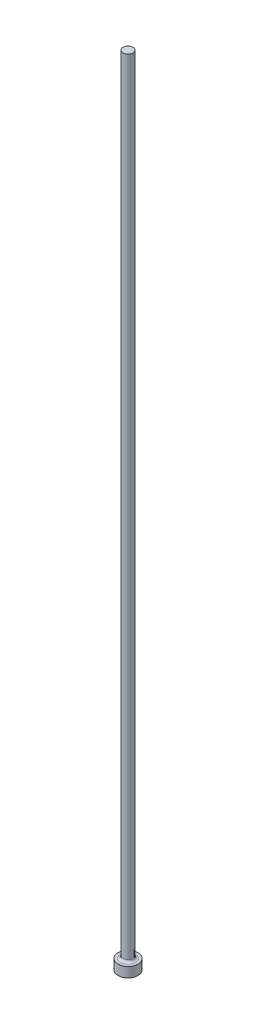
ISO-10303-21;
HEADER;
FILE_DESCRIPTION(('STEP AP214'),'2;1');
FILE_NAME('part.step','',(''),(''),'','','');
FILE_SCHEMA(('AUTOMOTIVE_DESIGN { 1 0 10303 214 1 1 1 1 }'));
ENDSEC;
DATA;
#1=APPLICATION_CONTEXT('core data for automotive mechanical design processes');
#2=APPLICATION_PROTOCOL_DEFINITION('international standard','automotive_design',2000,#1);
#3=PRODUCT_CONTEXT('',#1,'mechanical');
#4=PRODUCT('Part','Part','',(#3));
#5=PRODUCT_RELATED_PRODUCT_CATEGORY('part','',(#4));
#6=PRODUCT_DEFINITION_FORMATION('','',#4);
#7=PRODUCT_DEFINITION_CONTEXT('part definition',#1,'design');
#8=PRODUCT_DEFINITION('design','',#6,#7);
#9=PRODUCT_DEFINITION_SHAPE('','',#8);
#10=(LENGTH_UNIT() NAMED_UNIT(*) SI_UNIT(.MILLI.,.METRE.));
#11=(NAMED_UNIT(*) PLANE_ANGLE_UNIT() SI_UNIT($,.RADIAN.));
#12=(NAMED_UNIT(*) SI_UNIT($,.STERADIAN.) SOLID_ANGLE_UNIT());
#13=UNCERTAINTY_MEASURE_WITH_UNIT(LENGTH_MEASURE(1.E-05),#10,'distance_accuracy_value','');
#14=(GEOMETRIC_REPRESENTATION_CONTEXT(3) GLOBAL_UNCERTAINTY_ASSIGNED_CONTEXT((#13)) GLOBAL_UNIT_ASSIGNED_CONTEXT((#10,
#11,#12)) REPRESENTATION_CONTEXT('',''));
#15=CARTESIAN_POINT('',(0.,0.,0.));
#16=DIRECTION('',(0.,0.,1.));
#17=DIRECTION('',(1.,0.,0.));
#18=AXIS2_PLACEMENT_3D('',#15,#16,#17);
#19=CARTESIAN_POINT('',(1.58749999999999,254.,0.));
#20=DIRECTION('',(0.,-1.,0.));
#21=DIRECTION('',(1.,0.,0.));
#22=AXIS2_PLACEMENT_3D('',#19,#20,#21);
#23=PLANE('',#22);
#24=CARTESIAN_POINT('',(0.,254.,0.));
#25=DIRECTION('',(0.,1.,0.));
#26=DIRECTION('',(-1.,0.,0.));
#27=AXIS2_PLACEMENT_3D('',#24,#25,#26);
#28=CIRCLE('',#27,1.5875);
#29=CARTESIAN_POINT('',(-1.58750000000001,254.,0.));
#30=VERTEX_POINT('',#29);
#31=EDGE_CURVE('E10',#30,#30,#28,.T.);
#32=ORIENTED_EDGE('',*,*,#31,.T.);
#33=EDGE_LOOP('',(#32));
#34=FACE_BOUND('',#33,.T.);
#35=ADVANCED_FACE('F30',(#34),#23,.F.);
#36=CARTESIAN_POINT('',(0.,254.,0.));
#37=DIRECTION('',(0.,1.,0.));
#38=DIRECTION('',(-1.,0.,0.));
#39=AXIS2_PLACEMENT_3D('',#36,#37,#38);
#40=CYLINDRICAL_SURFACE('',#39,1.5875);
#41=ORIENTED_EDGE('',*,*,#31,.F.);
#42=EDGE_LOOP('',(#41));
#43=FACE_BOUND('',#42,.T.);
#44=CARTESIAN_POINT('',(0.,3.93700000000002,0.));
#45=DIRECTION('',(0.,1.,0.));
#46=DIRECTION('',(-1.,0.,0.));
#47=AXIS2_PLACEMENT_3D('',#44,#45,#46);
#48=CIRCLE('',#47,1.5875);
#49=CARTESIAN_POINT('',(-1.5875,3.93700000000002,0.));
#50=VERTEX_POINT('',#49);
#51=EDGE_CURVE('E36',#50,#50,#48,.T.);
#52=ORIENTED_EDGE('',*,*,#51,.T.);
#53=EDGE_LOOP('',(#52));
#54=FACE_BOUND('',#53,.T.);
#55=ADVANCED_FACE('F65',(#43,#54),#40,.T.);
#56=CARTESIAN_POINT('',(0.,3.937,0.));
#57=DIRECTION('',(0.,1.,0.));
#58=DIRECTION('',(-1.,0.,0.));
#59=AXIS2_PLACEMENT_3D('',#56,#57,#58);
#60=TOROIDAL_SURFACE('',#59,2.3495,0.762);
#61=ORIENTED_EDGE('',*,*,#51,.F.);
#62=EDGE_LOOP('',(#61));
#63=FACE_BOUND('',#62,.T.);
#64=CARTESIAN_POINT('',(0.,3.17499999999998,0.));
#65=DIRECTION('',(0.,1.,0.));
#66=DIRECTION('',(-1.,0.,0.));
#67=AXIS2_PLACEMENT_3D('',#64,#65,#66);
#68=CIRCLE('',#67,2.34950000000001);
#69=CARTESIAN_POINT('',(-2.34950000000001,3.17499999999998,0.));
#70=VERTEX_POINT('',#69);
#71=EDGE_CURVE('E40',#70,#70,#68,.T.);
#72=ORIENTED_EDGE('',*,*,#71,.T.);
#73=EDGE_LOOP('',(#72));
#74=FACE_BOUND('',#73,.T.);
#75=ADVANCED_FACE('F69',(#63,#74),#60,.F.);
#76=CARTESIAN_POINT('',(3.175,3.175,0.));
#77=DIRECTION('',(0.,-1.,0.));
#78=DIRECTION('',(1.,0.,0.));
#79=AXIS2_PLACEMENT_3D('',#76,#77,#78);
#80=PLANE('',#79);
#81=ORIENTED_EDGE('',*,*,#71,.F.);
#82=EDGE_LOOP('',(#81));
#83=FACE_BOUND('',#82,.T.);
#84=CARTESIAN_POINT('',(0.,3.17499999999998,0.));
#85=DIRECTION('',(0.,1.,0.));
#86=DIRECTION('',(-1.,0.,0.));
#87=AXIS2_PLACEMENT_3D('',#84,#85,#86);
#88=CIRCLE('',#87,3.175);
#89=CARTESIAN_POINT('',(-3.175,3.17499999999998,0.));
#90=VERTEX_POINT('',#89);
#91=EDGE_CURVE('E44',#90,#90,#88,.T.);
#92=ORIENTED_EDGE('',*,*,#91,.T.);
#93=EDGE_LOOP('',(#92));
#94=FACE_BOUND('',#93,.T.);
#95=ADVANCED_FACE('F61',(#83,#94),#80,.F.);
#96=CARTESIAN_POINT('',(0.,254.,0.));
#97=DIRECTION('',(0.,1.,0.));
#98=DIRECTION('',(-1.,0.,0.));
#99=AXIS2_PLACEMENT_3D('',#96,#97,#98);
#100=CYLINDRICAL_SURFACE('',#99,3.175);
#101=ORIENTED_EDGE('',*,*,#91,.F.);
#102=EDGE_LOOP('',(#101));
#103=FACE_BOUND('',#102,.T.);
#104=CARTESIAN_POINT('',(0.,0.,0.));
#105=DIRECTION('',(0.,1.,0.));
#106=DIRECTION('',(-1.,0.,0.));
#107=AXIS2_PLACEMENT_3D('',#104,#105,#106);
#108=CIRCLE('',#107,3.175);
#109=CARTESIAN_POINT('',(-3.175,0.,0.));
#110=VERTEX_POINT('',#109);
#111=EDGE_CURVE('E49',#110,#110,#108,.T.);
#112=ORIENTED_EDGE('',*,*,#111,.T.);
#113=EDGE_LOOP('',(#112));
#114=FACE_BOUND('',#113,.T.);
#115=ADVANCED_FACE('F53',(#103,#114),#100,.T.);
#116=CARTESIAN_POINT('',(0.,0.,0.));
#117=DIRECTION('',(0.,1.,0.));
#118=DIRECTION('',(-1.,0.,0.));
#119=AXIS2_PLACEMENT_3D('',#116,#117,#118);
#120=PLANE('',#119);
#121=ORIENTED_EDGE('',*,*,#111,.F.);
#122=EDGE_LOOP('',(#121));
#123=FACE_BOUND('',#122,.T.);
#124=ADVANCED_FACE('F55',(#123),#120,.F.);
#125=CLOSED_SHELL('',(#35,#55,#75,#95,#115,#124));
#126=MANIFOLD_SOLID_BREP('B2',#125);
#127=ADVANCED_BREP_SHAPE_REPRESENTATION('',(#18,#126),#14);
#128=SHAPE_DEFINITION_REPRESENTATION(#9,#127);
ENDSEC;
END-ISO-10303-21;
